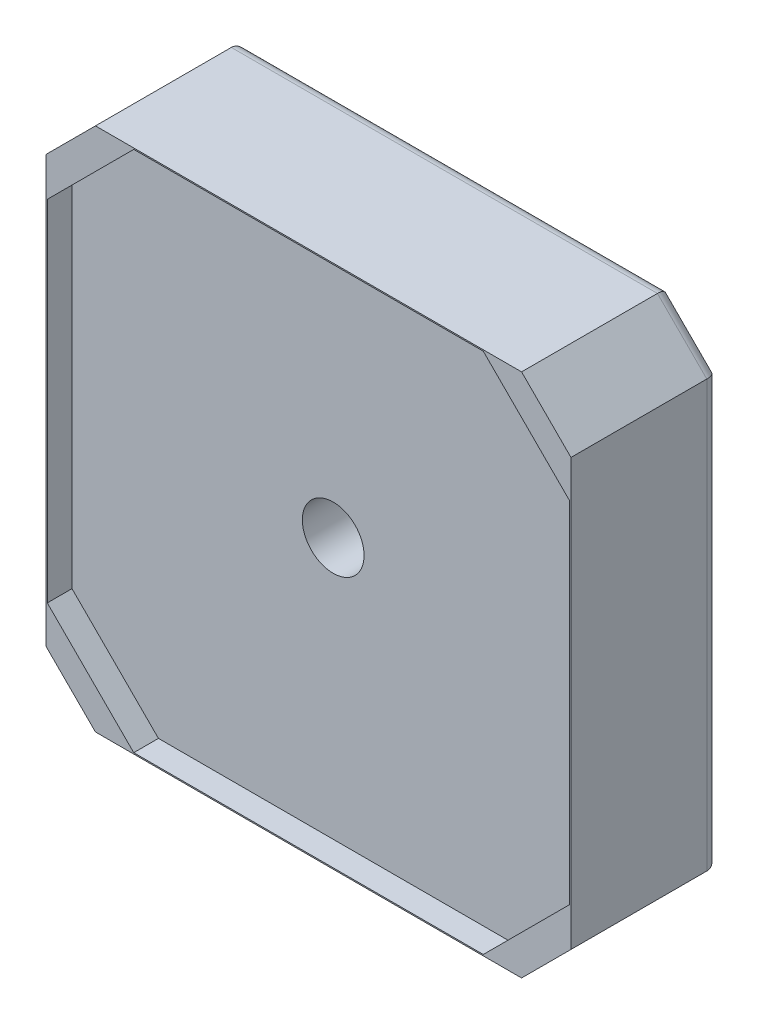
from build123d import *

# Parameters (mm, degrees)
BOSS_EXTRUDE1_DEPTH = 12
CUT_EXTRUDE1_DEPTH  = 2
SKETCH3_R           = 11
BOSS_EXTRUDE2_DEPTH = 2
SKETCH4_R           = 5.5
CUT_EXTRUDE2_DEPTH  = 7
SKETCH5_R           = 2.5
CUT_EXTRUDE3_DEPTH  = 31.856522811
FILLET1_R           = 1
FILLET3_R           = 0.5
SKETCH6_R           = 1
CUT_EXTRUDE4_DEPTH  = 3
FILLET4_R           = 0.5


with BuildPart() as part:
    # Sketch1 → Boss-Extrude1 (new body)
    with BuildSketch(Plane.XY):
        Polygon((-21.25, 17.25), (-17.25, 21.25), (17.25, 21.25), (21.25, 17.25), (21.25, -17.25), (17.25, -21.25), (-17.25, -21.25), (-21.25, -17.25), align=None)
    extrude(amount=BOSS_EXTRUDE1_DEPTH)

    # Sketch2 → Cut-Extrude1 (cut)
    with BuildSketch(Plane.XY.offset(12)):
        Polygon((-21.15, 14.15), (-14.15, 21.15), (14.15, 21.15), (21.15, 14.15), (21.15, -14.15), (14.15, -21.15), (-14.15, -21.15), (-21.15, -14.15), align=None)
    extrude(amount=-CUT_EXTRUDE1_DEPTH, mode=Mode.SUBTRACT)

    # Sketch3 → Boss-Extrude2 (add)
    with BuildSketch(Plane(origin=(0, 0, 0), x_dir=(-1, 0, 0), z_dir=(0, 0, -1))):
        Circle(SKETCH3_R)
    extrude(amount=BOSS_EXTRUDE2_DEPTH)

    # Sketch4 → Cut-Extrude2 (cut)
    with BuildSketch(Plane(origin=(0, 0, -2), x_dir=(-1, 0, 0), z_dir=(0, 0, -1))):
        Circle(SKETCH4_R)
    extrude(amount=-CUT_EXTRUDE2_DEPTH, mode=Mode.SUBTRACT)

    # Sketch5 → Cut-Extrude3 (cut, through all)
    with BuildSketch(Plane(origin=(0, 0, 5), x_dir=(-1, 0, 0), z_dir=(0, 0, -1))):
        Circle(SKETCH5_R)
    extrude(amount=-CUT_EXTRUDE3_DEPTH, mode=Mode.SUBTRACT)

    # Fillet1
    fillet1_edges = [part.edges().sort_by_distance(p)[0] for p in [
        (-19.25, -19.25, 0),
        (-21.25, 0, 0),
        (-19.25, 19.25, 0),
        (0, 21.25, 0),
        (19.25, 19.25, 0),
        (21.25, 0, 0),
        (19.25, -19.25, 0),
        (0, -21.25, 0),
    ]]
    fillet(fillet1_edges, radius=FILLET1_R)

    # Fillet3
    fillet3_edges = [part.edges().sort_by_distance(p)[0] for p in [
        (11, 0, -2),
        (5.5, 0, 5),
        (5.5, 0, -2),
    ]]
    fillet(fillet3_edges, radius=FILLET3_R)

    # Sketch6 → Cut-Extrude4 (cut)
    with BuildSketch(Plane(origin=(0, 0, 0), x_dir=(-1, 0, 0), z_dir=(0, 0, -1))):
        with Locations((-15.5, 15.5)):
            Circle(SKETCH6_R)
        with Locations((15.5, 15.5)):
            Circle(SKETCH6_R)
        with Locations((15.5, -15.5)):
            Circle(SKETCH6_R)
        with Locations((-15.5, -15.5)):
            Circle(SKETCH6_R)
    extrude(amount=-CUT_EXTRUDE4_DEPTH, mode=Mode.SUBTRACT)

    # Fillet4
    fillet4_edges = [part.edges().sort_by_distance(p)[0] for p in [
        (-14.5, 15.5, 0),
        (-14.5, -15.5, 0),
        (16.5, -15.5, 0),
        (16.5, 15.5, 0),
    ]]
    fillet(fillet4_edges, radius=FILLET4_R)


solid = part.part
